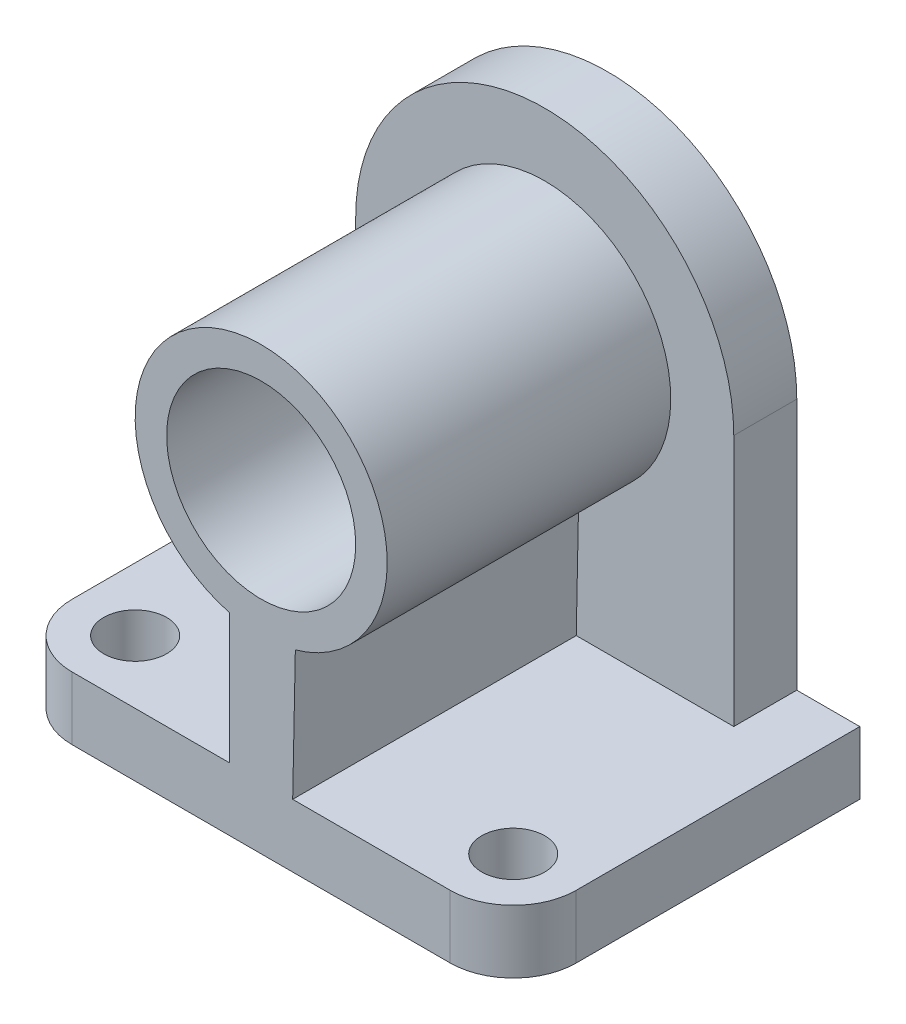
from build123d import *

# Parameters (mm, degrees)
SKETCH_1_R      = 5
EXTRUDE_1_DEPTH = 10
SKETCH_2_R      = 15
EXTRUDE_2_DEPTH = 10
SKETCH_3_R      = 15
EXTRUDE_3_DEPTH = 45


with BuildPart() as part:
    # Sketch 1 → Extrude 1 (new body)
    with BuildSketch(Plane(origin=(0, 0, 0), x_dir=(1, 0, 0), z_dir=(0, 1, 0))):
        with BuildLine():
            Line((40, 0), (-40, 0))
            Line((-40, 0), (-40, -45))
            ThreePointArc((-40, -45), (-37.071067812, -52.071067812), (-30, -55))
            Line((-30, -55), (30, -55))
            ThreePointArc((30, -55), (37.071067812, -52.071067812), (40, -45))
            Line((40, -45), (40, 0))
        make_face()
        with Locations(Location((-30, -45, 0), (0, 0, 270))):
            Circle(SKETCH_1_R, mode=Mode.SUBTRACT)
        with Locations(Location((30, -45, 0), (0, 0, 90))):
            Circle(SKETCH_1_R, mode=Mode.SUBTRACT)
    extrude(amount=EXTRUDE_1_DEPTH)

    # Sketch 2 → Extrude 2 (add)
    with BuildSketch(Plane.XY):
        with BuildLine():
            Line((-30, 50), (-30, 10))
            Line((-30, 10), (30, 10))
            Line((30, 10), (30, 50))
            ThreePointArc((30, 50), (0, 80), (-30, 50))
        make_face()
        with Locations((0, 50)):
            Circle(SKETCH_2_R, mode=Mode.SUBTRACT)
    extrude(amount=EXTRUDE_2_DEPTH)

    # Sketch 3 → Extrude 3 (add)
    with BuildSketch(Plane.XY.offset(10)):
        with BuildLine():
            Line((-5, 30.635083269), (-5, 10))
            Line((-5, 10), (5, 10))
            Line((5, 10), (5.420465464, 30.748544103))
            ThreePointArc((5.420465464, 30.748544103), (-0.217752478, 69.998814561), (-5, 30.635083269))
        make_face()
        with Locations((0, 50)):
            Circle(SKETCH_3_R, mode=Mode.SUBTRACT)
    extrude(amount=EXTRUDE_3_DEPTH)


solid = part.part
